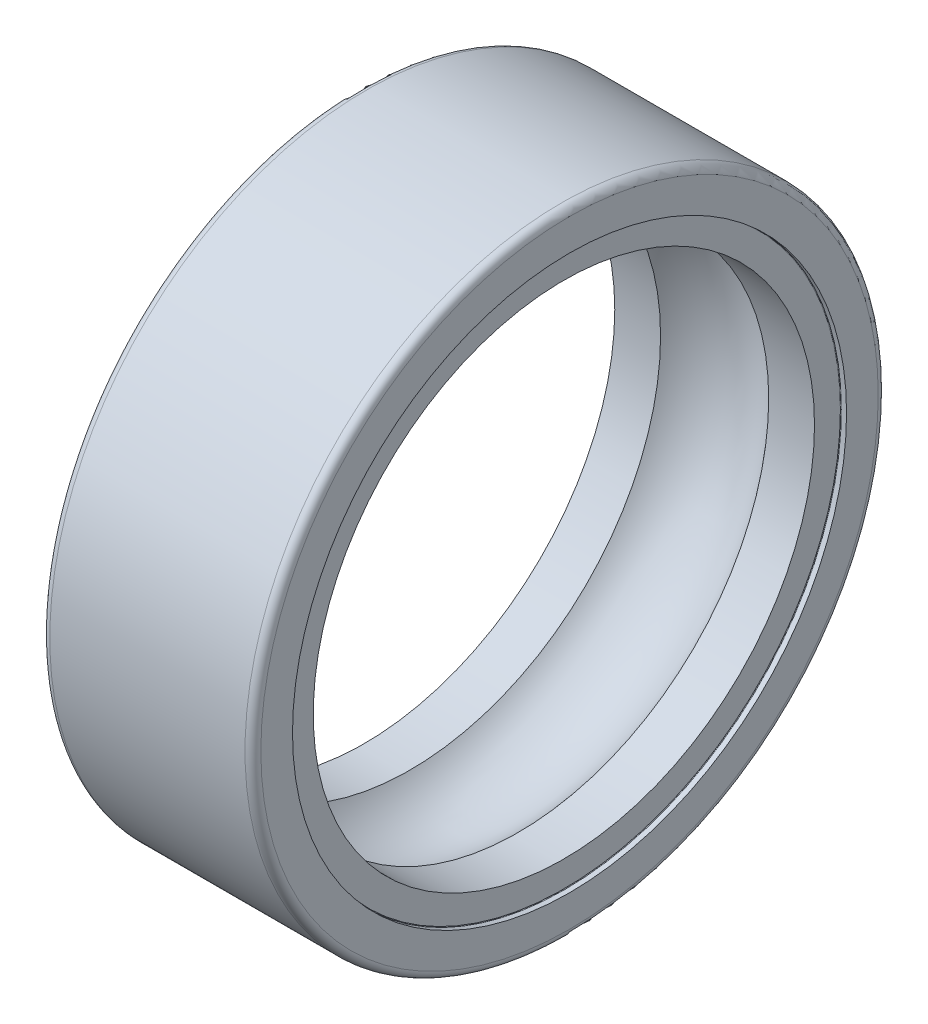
ISO-10303-21;
HEADER;
FILE_DESCRIPTION(('STEP AP214'),'2;1');
FILE_NAME('part.step','',(''),(''),'','','');
FILE_SCHEMA(('AUTOMOTIVE_DESIGN { 1 0 10303 214 1 1 1 1 }'));
ENDSEC;
DATA;
#1=APPLICATION_CONTEXT('core data for automotive mechanical design processes');
#2=APPLICATION_PROTOCOL_DEFINITION('international standard','automotive_design',2000,#1);
#3=PRODUCT_CONTEXT('',#1,'mechanical');
#4=PRODUCT('Part','Part','',(#3));
#5=PRODUCT_RELATED_PRODUCT_CATEGORY('part','',(#4));
#6=PRODUCT_DEFINITION_FORMATION('','',#4);
#7=PRODUCT_DEFINITION_CONTEXT('part definition',#1,'design');
#8=PRODUCT_DEFINITION('design','',#6,#7);
#9=PRODUCT_DEFINITION_SHAPE('','',#8);
#10=(LENGTH_UNIT() NAMED_UNIT(*) SI_UNIT(.MILLI.,.METRE.));
#11=(NAMED_UNIT(*) PLANE_ANGLE_UNIT() SI_UNIT($,.RADIAN.));
#12=(NAMED_UNIT(*) SI_UNIT($,.STERADIAN.) SOLID_ANGLE_UNIT());
#13=UNCERTAINTY_MEASURE_WITH_UNIT(LENGTH_MEASURE(1.E-05),#10,'distance_accuracy_value','');
#14=(GEOMETRIC_REPRESENTATION_CONTEXT(3) GLOBAL_UNCERTAINTY_ASSIGNED_CONTEXT((#13)) GLOBAL_UNIT_ASSIGNED_CONTEXT((#10,
#11,#12)) REPRESENTATION_CONTEXT('',''));
#15=CARTESIAN_POINT('',(0.,0.,0.));
#16=DIRECTION('',(0.,0.,1.));
#17=DIRECTION('',(1.,0.,0.));
#18=AXIS2_PLACEMENT_3D('',#15,#16,#17);
#19=CARTESIAN_POINT('',(-4.,11.7,0.));
#20=DIRECTION('',(-1.,0.,0.));
#21=DIRECTION('',(0.,0.,1.));
#22=AXIS2_PLACEMENT_3D('',#19,#20,#21);
#23=PLANE('',#22);
#24=CARTESIAN_POINT('',(-4.,0.,0.));
#25=DIRECTION('',(1.,0.,0.));
#26=DIRECTION('',(0.,0.,-1.));
#27=AXIS2_PLACEMENT_3D('',#24,#25,#26);
#28=CIRCLE('',#27,10.5);
#29=CARTESIAN_POINT('',(-4.,0.,-10.5));
#30=VERTEX_POINT('',#29);
#31=EDGE_CURVE('E5',#30,#30,#28,.T.);
#32=ORIENTED_EDGE('',*,*,#31,.T.);
#33=EDGE_LOOP('',(#32));
#34=FACE_BOUND('',#33,.T.);
#35=CARTESIAN_POINT('',(-4.,0.,0.));
#36=DIRECTION('',(1.,0.,0.));
#37=DIRECTION('',(0.,0.,-1.));
#38=AXIS2_PLACEMENT_3D('',#35,#36,#37);
#39=CIRCLE('',#38,11.7000000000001);
#40=CARTESIAN_POINT('',(-4.,0.,-11.7000000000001));
#41=VERTEX_POINT('',#40);
#42=EDGE_CURVE('E9',#41,#41,#39,.T.);
#43=ORIENTED_EDGE('',*,*,#42,.F.);
#44=EDGE_LOOP('',(#43));
#45=FACE_BOUND('',#44,.T.);
#46=ADVANCED_FACE('F13',(#34,#45),#23,.T.);
#47=CARTESIAN_POINT('',(4.,0.,0.));
#48=DIRECTION('',(1.,0.,0.));
#49=DIRECTION('',(0.,0.,-1.));
#50=AXIS2_PLACEMENT_3D('',#47,#48,#49);
#51=CYLINDRICAL_SURFACE('',#50,10.5);
#52=CARTESIAN_POINT('',(-3.8053658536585,0.,0.));
#53=DIRECTION('',(1.,0.,0.));
#54=DIRECTION('',(0.,0.,-1.));
#55=AXIS2_PLACEMENT_3D('',#52,#53,#54);
#56=CIRCLE('',#55,10.5);
#57=CARTESIAN_POINT('',(-3.8053658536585,0.,-10.5));
#58=VERTEX_POINT('',#57);
#59=EDGE_CURVE('E24',#58,#58,#56,.T.);
#60=ORIENTED_EDGE('',*,*,#59,.T.);
#61=EDGE_LOOP('',(#60));
#62=FACE_BOUND('',#61,.T.);
#63=ORIENTED_EDGE('',*,*,#31,.F.);
#64=EDGE_LOOP('',(#63));
#65=FACE_BOUND('',#64,.T.);
#66=ADVANCED_FACE('F30',(#62,#65),#51,.F.);
#67=CARTESIAN_POINT('',(-3.70000000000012,0.,0.));
#68=DIRECTION('',(1.,0.,0.));
#69=DIRECTION('',(0.,0.,-1.));
#70=AXIS2_PLACEMENT_3D('',#67,#68,#69);
#71=TOROIDAL_SURFACE('',#70,11.7000000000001,0.299999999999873);
#72=ORIENTED_EDGE('',*,*,#42,.T.);
#73=EDGE_LOOP('',(#72));
#74=FACE_BOUND('',#73,.T.);
#75=CARTESIAN_POINT('',(-3.7,0.,0.));
#76=DIRECTION('',(1.,0.,0.));
#77=DIRECTION('',(0.,0.,-1.));
#78=AXIS2_PLACEMENT_3D('',#75,#76,#77);
#79=CIRCLE('',#78,12.);
#80=CARTESIAN_POINT('',(-3.7,0.,-12.));
#81=VERTEX_POINT('',#80);
#82=EDGE_CURVE('E39',#81,#81,#79,.T.);
#83=ORIENTED_EDGE('',*,*,#82,.F.);
#84=EDGE_LOOP('',(#83));
#85=FACE_BOUND('',#84,.T.);
#86=ADVANCED_FACE('F43',(#74,#85),#71,.T.);
#87=CARTESIAN_POINT('',(-3.80536585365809,0.,0.));
#88=DIRECTION('',(1.,0.,0.));
#89=DIRECTION('',(0.,0.,-1.));
#90=AXIS2_PLACEMENT_3D('',#87,#88,#89);
#91=TOROIDAL_SURFACE('',#90,10.4800000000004,0.0199999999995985);
#92=ORIENTED_EDGE('',*,*,#59,.F.);
#93=EDGE_LOOP('',(#92));
#94=FACE_BOUND('',#93,.T.);
#95=CARTESIAN_POINT('',(-3.7853658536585,0.,0.));
#96=DIRECTION('',(1.,0.,0.));
#97=DIRECTION('',(0.,0.,-1.));
#98=AXIS2_PLACEMENT_3D('',#95,#96,#97);
#99=CIRCLE('',#98,10.4799999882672);
#100=CARTESIAN_POINT('',(-3.7853658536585,0.,-10.4799999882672));
#101=VERTEX_POINT('',#100);
#102=EDGE_CURVE('E52',#101,#101,#99,.T.);
#103=ORIENTED_EDGE('',*,*,#102,.T.);
#104=EDGE_LOOP('',(#103));
#105=FACE_BOUND('',#104,.T.);
#106=ADVANCED_FACE('F56',(#94,#105),#91,.F.);
#107=CARTESIAN_POINT('',(4.,0.,0.));
#108=DIRECTION('',(1.,0.,0.));
#109=DIRECTION('',(0.,0.,-1.));
#110=AXIS2_PLACEMENT_3D('',#107,#108,#109);
#111=CYLINDRICAL_SURFACE('',#110,12.);
#112=ORIENTED_EDGE('',*,*,#82,.T.);
#113=EDGE_LOOP('',(#112));
#114=FACE_BOUND('',#113,.T.);
#115=CARTESIAN_POINT('',(3.7,0.,0.));
#116=DIRECTION('',(1.,0.,0.));
#117=DIRECTION('',(0.,0.,-1.));
#118=AXIS2_PLACEMENT_3D('',#115,#116,#117);
#119=CIRCLE('',#118,12.);
#120=CARTESIAN_POINT('',(3.7,0.,-12.));
#121=VERTEX_POINT('',#120);
#122=EDGE_CURVE('E65',#121,#121,#119,.T.);
#123=ORIENTED_EDGE('',*,*,#122,.F.);
#124=EDGE_LOOP('',(#123));
#125=FACE_BOUND('',#124,.T.);
#126=ADVANCED_FACE('F69',(#114,#125),#111,.T.);
#127=CARTESIAN_POINT('',(-3.7853658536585,10.48,0.));
#128=DIRECTION('',(-1.,0.,0.));
#129=DIRECTION('',(0.,0.,1.));
#130=AXIS2_PLACEMENT_3D('',#127,#128,#129);
#131=PLANE('',#130);
#132=CARTESIAN_POINT('',(-3.7853658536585,0.,0.));
#133=DIRECTION('',(1.,0.,0.));
#134=DIRECTION('',(0.,0.,-1.));
#135=AXIS2_PLACEMENT_3D('',#132,#133,#134);
#136=CIRCLE('',#135,9.5);
#137=CARTESIAN_POINT('',(-3.7853658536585,0.,-9.5));
#138=VERTEX_POINT('',#137);
#139=EDGE_CURVE('E76',#138,#138,#136,.T.);
#140=ORIENTED_EDGE('',*,*,#139,.T.);
#141=EDGE_LOOP('',(#140));
#142=FACE_BOUND('',#141,.T.);
#143=ORIENTED_EDGE('',*,*,#102,.F.);
#144=EDGE_LOOP('',(#143));
#145=FACE_BOUND('',#144,.T.);
#146=ADVANCED_FACE('F82',(#142,#145),#131,.T.);
#147=CARTESIAN_POINT('',(3.70000000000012,0.,0.));
#148=DIRECTION('',(1.,0.,0.));
#149=DIRECTION('',(0.,0.,-1.));
#150=AXIS2_PLACEMENT_3D('',#147,#148,#149);
#151=TOROIDAL_SURFACE('',#150,11.7000000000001,0.299999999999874);
#152=ORIENTED_EDGE('',*,*,#122,.T.);
#153=EDGE_LOOP('',(#152));
#154=FACE_BOUND('',#153,.T.);
#155=CARTESIAN_POINT('',(4.,0.,0.));
#156=DIRECTION('',(1.,0.,0.));
#157=DIRECTION('',(0.,0.,-1.));
#158=AXIS2_PLACEMENT_3D('',#155,#156,#157);
#159=CIRCLE('',#158,11.7000000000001);
#160=CARTESIAN_POINT('',(4.,0.,-11.7000000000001));
#161=VERTEX_POINT('',#160);
#162=EDGE_CURVE('E91',#161,#161,#159,.T.);
#163=ORIENTED_EDGE('',*,*,#162,.F.);
#164=EDGE_LOOP('',(#163));
#165=FACE_BOUND('',#164,.T.);
#166=ADVANCED_FACE('F95',(#154,#165),#151,.T.);
#167=CARTESIAN_POINT('',(4.,0.,0.));
#168=DIRECTION('',(1.,0.,0.));
#169=DIRECTION('',(0.,0.,-1.));
#170=AXIS2_PLACEMENT_3D('',#167,#168,#169);
#171=CYLINDRICAL_SURFACE('',#170,9.5);
#172=CARTESIAN_POINT('',(-2.0493901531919,0.,0.));
#173=DIRECTION('',(1.,0.,0.));
#174=DIRECTION('',(0.,0.,-1.));
#175=AXIS2_PLACEMENT_3D('',#172,#173,#174);
#176=CIRCLE('',#175,9.5);
#177=CARTESIAN_POINT('',(-2.0493901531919,0.,-9.5));
#178=VERTEX_POINT('',#177);
#179=EDGE_CURVE('E102',#178,#178,#176,.T.);
#180=ORIENTED_EDGE('',*,*,#179,.T.);
#181=EDGE_LOOP('',(#180));
#182=FACE_BOUND('',#181,.T.);
#183=ORIENTED_EDGE('',*,*,#139,.F.);
#184=EDGE_LOOP('',(#183));
#185=FACE_BOUND('',#184,.T.);
#186=ADVANCED_FACE('F108',(#182,#185),#171,.F.);
#187=CARTESIAN_POINT('',(4.,10.5,0.));
#188=DIRECTION('',(1.,0.,0.));
#189=DIRECTION('',(0.,0.,-1.));
#190=AXIS2_PLACEMENT_3D('',#187,#188,#189);
#191=PLANE('',#190);
#192=ORIENTED_EDGE('',*,*,#162,.T.);
#193=EDGE_LOOP('',(#192));
#194=FACE_BOUND('',#193,.T.);
#195=CARTESIAN_POINT('',(4.,0.,0.));
#196=DIRECTION('',(1.,0.,0.));
#197=DIRECTION('',(0.,0.,-1.));
#198=AXIS2_PLACEMENT_3D('',#195,#196,#197);
#199=CIRCLE('',#198,10.5);
#200=CARTESIAN_POINT('',(4.,0.,-10.5));
#201=VERTEX_POINT('',#200);
#202=EDGE_CURVE('E117',#201,#201,#199,.T.);
#203=ORIENTED_EDGE('',*,*,#202,.F.);
#204=EDGE_LOOP('',(#203));
#205=FACE_BOUND('',#204,.T.);
#206=ADVANCED_FACE('F121',(#194,#205),#191,.T.);
#207=CARTESIAN_POINT('',(0.,0.,0.));
#208=DIRECTION('',(1.,0.,0.));
#209=DIRECTION('',(0.,0.,-1.));
#210=AXIS2_PLACEMENT_3D('',#207,#208,#209);
#211=TOROIDAL_SURFACE('',#210,7.9,2.59999999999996);
#212=ORIENTED_EDGE('',*,*,#179,.F.);
#213=EDGE_LOOP('',(#212));
#214=FACE_BOUND('',#213,.T.);
#215=CARTESIAN_POINT('',(2.0493901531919,0.,0.));
#216=DIRECTION('',(1.,0.,0.));
#217=DIRECTION('',(0.,0.,-1.));
#218=AXIS2_PLACEMENT_3D('',#215,#216,#217);
#219=CIRCLE('',#218,9.5);
#220=CARTESIAN_POINT('',(2.0493901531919,0.,-9.5));
#221=VERTEX_POINT('',#220);
#222=EDGE_CURVE('E130',#221,#221,#219,.T.);
#223=ORIENTED_EDGE('',*,*,#222,.T.);
#224=EDGE_LOOP('',(#223));
#225=FACE_BOUND('',#224,.T.);
#226=ADVANCED_FACE('F134',(#214,#225),#211,.F.);
#227=CARTESIAN_POINT('',(4.,0.,0.));
#228=DIRECTION('',(1.,0.,0.));
#229=DIRECTION('',(0.,0.,-1.));
#230=AXIS2_PLACEMENT_3D('',#227,#228,#229);
#231=CYLINDRICAL_SURFACE('',#230,10.5);
#232=ORIENTED_EDGE('',*,*,#202,.T.);
#233=EDGE_LOOP('',(#232));
#234=FACE_BOUND('',#233,.T.);
#235=CARTESIAN_POINT('',(3.8053658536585,0.,0.));
#236=DIRECTION('',(1.,0.,0.));
#237=DIRECTION('',(0.,0.,-1.));
#238=AXIS2_PLACEMENT_3D('',#235,#236,#237);
#239=CIRCLE('',#238,10.5);
#240=CARTESIAN_POINT('',(3.8053658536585,0.,-10.5));
#241=VERTEX_POINT('',#240);
#242=EDGE_CURVE('E143',#241,#241,#239,.T.);
#243=ORIENTED_EDGE('',*,*,#242,.F.);
#244=EDGE_LOOP('',(#243));
#245=FACE_BOUND('',#244,.T.);
#246=ADVANCED_FACE('F147',(#234,#245),#231,.F.);
#247=CARTESIAN_POINT('',(4.,0.,0.));
#248=DIRECTION('',(1.,0.,0.));
#249=DIRECTION('',(0.,0.,-1.));
#250=AXIS2_PLACEMENT_3D('',#247,#248,#249);
#251=CYLINDRICAL_SURFACE('',#250,9.5);
#252=CARTESIAN_POINT('',(3.7853658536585,0.,0.));
#253=DIRECTION('',(1.,0.,0.));
#254=DIRECTION('',(0.,0.,-1.));
#255=AXIS2_PLACEMENT_3D('',#252,#253,#254);
#256=CIRCLE('',#255,9.5);
#257=CARTESIAN_POINT('',(3.7853658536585,0.,-9.5));
#258=VERTEX_POINT('',#257);
#259=EDGE_CURVE('E154',#258,#258,#256,.T.);
#260=ORIENTED_EDGE('',*,*,#259,.T.);
#261=EDGE_LOOP('',(#260));
#262=FACE_BOUND('',#261,.T.);
#263=ORIENTED_EDGE('',*,*,#222,.F.);
#264=EDGE_LOOP('',(#263));
#265=FACE_BOUND('',#264,.T.);
#266=ADVANCED_FACE('F160',(#262,#265),#251,.F.);
#267=CARTESIAN_POINT('',(3.80536585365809,0.,0.));
#268=DIRECTION('',(1.,0.,0.));
#269=DIRECTION('',(0.,0.,-1.));
#270=AXIS2_PLACEMENT_3D('',#267,#268,#269);
#271=TOROIDAL_SURFACE('',#270,10.4800000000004,0.0199999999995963);
#272=CARTESIAN_POINT('',(3.7853658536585,0.,0.));
#273=DIRECTION('',(1.,0.,0.));
#274=DIRECTION('',(0.,0.,-1.));
#275=AXIS2_PLACEMENT_3D('',#272,#273,#274);
#276=CIRCLE('',#275,10.4799999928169);
#277=CARTESIAN_POINT('',(3.7853658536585,0.,-10.4799999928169));
#278=VERTEX_POINT('',#277);
#279=EDGE_CURVE('E167',#278,#278,#276,.T.);
#280=ORIENTED_EDGE('',*,*,#279,.F.);
#281=EDGE_LOOP('',(#280));
#282=FACE_BOUND('',#281,.T.);
#283=ORIENTED_EDGE('',*,*,#242,.T.);
#284=EDGE_LOOP('',(#283));
#285=FACE_BOUND('',#284,.T.);
#286=ADVANCED_FACE('F173',(#282,#285),#271,.F.);
#287=CARTESIAN_POINT('',(3.7853658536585,9.5,0.));
#288=DIRECTION('',(1.,0.,0.));
#289=DIRECTION('',(0.,0.,-1.));
#290=AXIS2_PLACEMENT_3D('',#287,#288,#289);
#291=PLANE('',#290);
#292=ORIENTED_EDGE('',*,*,#279,.T.);
#293=EDGE_LOOP('',(#292));
#294=FACE_BOUND('',#293,.T.);
#295=ORIENTED_EDGE('',*,*,#259,.F.);
#296=EDGE_LOOP('',(#295));
#297=FACE_BOUND('',#296,.T.);
#298=ADVANCED_FACE('F184',(#294,#297),#291,.T.);
#299=CLOSED_SHELL('',(#46,#66,#86,#106,#126,#146,#166,#186,#206,#226,#246,#266,#286,#298));
#300=MANIFOLD_SOLID_BREP('B1',#299);
#301=ADVANCED_BREP_SHAPE_REPRESENTATION('',(#18,#300),#14);
#302=SHAPE_DEFINITION_REPRESENTATION(#9,#301);
ENDSEC;
END-ISO-10303-21;
